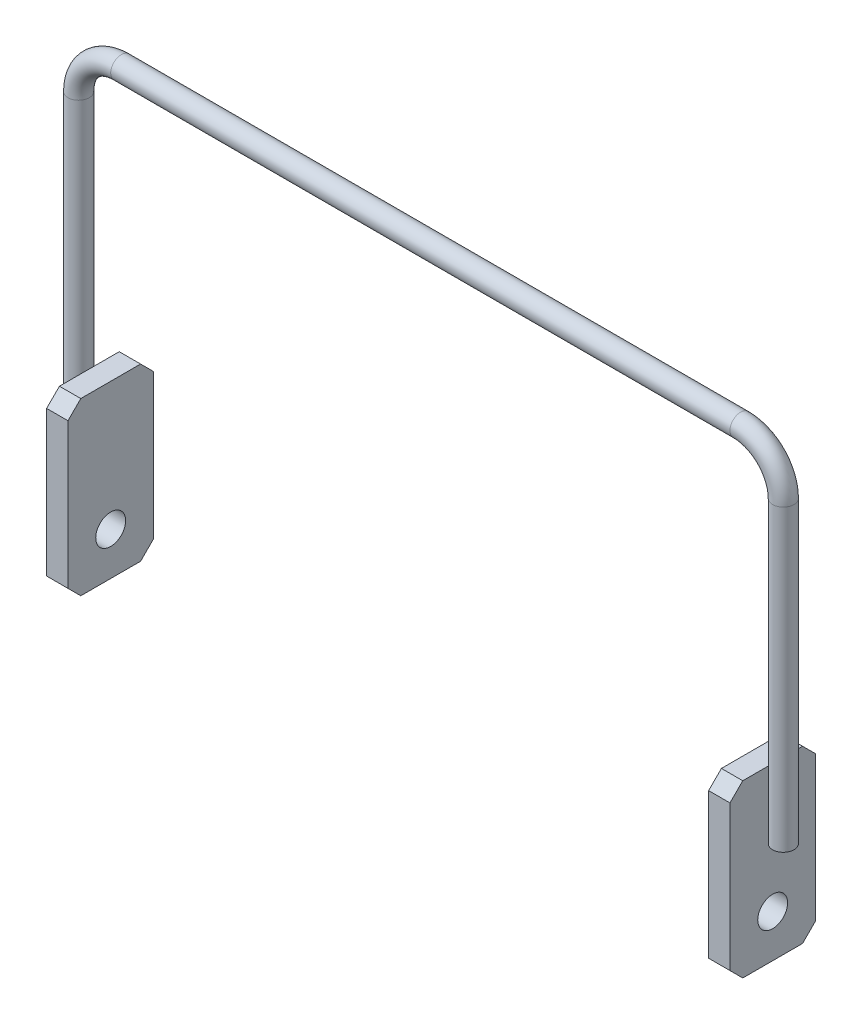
ISO-10303-21;
HEADER;
FILE_DESCRIPTION(('STEP AP214'),'2;1');
FILE_NAME('part.step','',(''),(''),'','','');
FILE_SCHEMA(('AUTOMOTIVE_DESIGN { 1 0 10303 214 1 1 1 1 }'));
ENDSEC;
DATA;
#1=APPLICATION_CONTEXT('core data for automotive mechanical design processes');
#2=APPLICATION_PROTOCOL_DEFINITION('international standard','automotive_design',2000,#1);
#3=PRODUCT_CONTEXT('',#1,'mechanical');
#4=PRODUCT('Part','Part','',(#3));
#5=PRODUCT_RELATED_PRODUCT_CATEGORY('part','',(#4));
#6=PRODUCT_DEFINITION_FORMATION('','',#4);
#7=PRODUCT_DEFINITION_CONTEXT('part definition',#1,'design');
#8=PRODUCT_DEFINITION('design','',#6,#7);
#9=PRODUCT_DEFINITION_SHAPE('','',#8);
#10=(LENGTH_UNIT() NAMED_UNIT(*) SI_UNIT(.MILLI.,.METRE.));
#11=(NAMED_UNIT(*) PLANE_ANGLE_UNIT() SI_UNIT($,.RADIAN.));
#12=(NAMED_UNIT(*) SI_UNIT($,.STERADIAN.) SOLID_ANGLE_UNIT());
#13=UNCERTAINTY_MEASURE_WITH_UNIT(LENGTH_MEASURE(1.E-05),#10,'distance_accuracy_value','');
#14=(GEOMETRIC_REPRESENTATION_CONTEXT(3) GLOBAL_UNCERTAINTY_ASSIGNED_CONTEXT((#13)) GLOBAL_UNIT_ASSIGNED_CONTEXT((#10,
#11,#12)) REPRESENTATION_CONTEXT('',''));
#15=CARTESIAN_POINT('',(0.,0.,0.));
#16=DIRECTION('',(0.,0.,1.));
#17=DIRECTION('',(1.,0.,0.));
#18=AXIS2_PLACEMENT_3D('',#15,#16,#17);
#19=CARTESIAN_POINT('',(-82.5,95.,0.));
#20=DIRECTION('',(0.,-1.,0.));
#21=DIRECTION('',(0.,0.,-1.));
#22=AXIS2_PLACEMENT_3D('',#19,#20,#21);
#23=CYLINDRICAL_SURFACE('',#22,2.49999999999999);
#24=CARTESIAN_POINT('',(-82.5,95.,0.));
#25=DIRECTION('',(0.,-1.,0.));
#26=DIRECTION('',(0.,0.,1.));
#27=AXIS2_PLACEMENT_3D('',#24,#25,#26);
#28=CIRCLE('',#27,2.49999999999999);
#29=CARTESIAN_POINT('',(-85.,95.,0.));
#30=VERTEX_POINT('',#29);
#31=EDGE_CURVE('E47',#30,#30,#28,.T.);
#32=ORIENTED_EDGE('',*,*,#31,.T.);
#33=EDGE_LOOP('',(#32));
#34=FACE_BOUND('',#33,.T.);
#35=CARTESIAN_POINT('',(-82.5,25.,0.));
#36=DIRECTION('',(0.,-1.,0.));
#37=DIRECTION('',(0.,0.,1.));
#38=AXIS2_PLACEMENT_3D('',#35,#36,#37);
#39=CIRCLE('',#38,2.49999999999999);
#40=CARTESIAN_POINT('',(-82.5,25.,2.49999999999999));
#41=VERTEX_POINT('',#40);
#42=EDGE_CURVE('E11',#41,#41,#39,.T.);
#43=ORIENTED_EDGE('',*,*,#42,.F.);
#44=EDGE_LOOP('',(#43));
#45=FACE_BOUND('',#44,.T.);
#46=ADVANCED_FACE('F41',(#34,#45),#23,.T.);
#47=CARTESIAN_POINT('',(-72.5,95.,0.));
#48=DIRECTION('',(0.,0.,1.));
#49=DIRECTION('',(1.,0.,0.));
#50=AXIS2_PLACEMENT_3D('',#47,#48,#49);
#51=TOROIDAL_SURFACE('',#50,10.,2.49999999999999);
#52=CARTESIAN_POINT('',(-72.5,105.,0.));
#53=DIRECTION('',(-1.,0.,0.));
#54=DIRECTION('',(0.,0.,1.));
#55=AXIS2_PLACEMENT_3D('',#52,#53,#54);
#56=CIRCLE('',#55,2.49999999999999);
#57=CARTESIAN_POINT('',(-72.5,107.5,0.));
#58=VERTEX_POINT('',#57);
#59=EDGE_CURVE('E51',#58,#58,#56,.T.);
#60=CARTESIAN_POINT('',(-72.5,95.,0.));
#61=DIRECTION('',(0.,0.,1.));
#62=DIRECTION('',(1.,0.,0.));
#63=AXIS2_PLACEMENT_3D('',#60,#61,#62);
#64=CIRCLE('',#63,12.5);
#65=EDGE_CURVE('',#58,#30,#64,.T.);
#66=ORIENTED_EDGE('',*,*,#59,.T.);
#67=ORIENTED_EDGE('',*,*,#31,.F.);
#68=ORIENTED_EDGE('',*,*,#65,.T.);
#69=ORIENTED_EDGE('',*,*,#65,.F.);
#70=EDGE_LOOP('',(#66,#68,#67,#69));
#71=FACE_BOUND('',#70,.T.);
#72=ADVANCED_FACE('F78',(#71),#51,.T.);
#73=CARTESIAN_POINT('',(72.5,105.,0.));
#74=DIRECTION('',(-1.,0.,0.));
#75=DIRECTION('',(0.,0.,1.));
#76=AXIS2_PLACEMENT_3D('',#73,#74,#75);
#77=CYLINDRICAL_SURFACE('',#76,2.49999999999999);
#78=CARTESIAN_POINT('',(72.5,105.,0.));
#79=DIRECTION('',(-1.,0.,0.));
#80=DIRECTION('',(0.,0.,1.));
#81=AXIS2_PLACEMENT_3D('',#78,#79,#80);
#82=CIRCLE('',#81,2.49999999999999);
#83=CARTESIAN_POINT('',(72.5,107.5,0.));
#84=VERTEX_POINT('',#83);
#85=EDGE_CURVE('E55',#84,#84,#82,.T.);
#86=ORIENTED_EDGE('',*,*,#85,.T.);
#87=EDGE_LOOP('',(#86));
#88=FACE_BOUND('',#87,.T.);
#89=ORIENTED_EDGE('',*,*,#59,.F.);
#90=EDGE_LOOP('',(#89));
#91=FACE_BOUND('',#90,.T.);
#92=ADVANCED_FACE('F82',(#88,#91),#77,.T.);
#93=CARTESIAN_POINT('',(72.5,95.,0.));
#94=DIRECTION('',(0.,0.,1.));
#95=DIRECTION('',(1.,0.,0.));
#96=AXIS2_PLACEMENT_3D('',#93,#94,#95);
#97=TOROIDAL_SURFACE('',#96,9.99999999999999,2.49999999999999);
#98=CARTESIAN_POINT('',(82.5,95.,0.));
#99=DIRECTION('',(0.,1.,0.));
#100=DIRECTION('',(0.,0.,1.));
#101=AXIS2_PLACEMENT_3D('',#98,#99,#100);
#102=CIRCLE('',#101,2.49999999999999);
#103=CARTESIAN_POINT('',(85.,95.,0.));
#104=VERTEX_POINT('',#103);
#105=EDGE_CURVE('E60',#104,#104,#102,.T.);
#106=CARTESIAN_POINT('',(72.5,95.,0.));
#107=DIRECTION('',(0.,0.,1.));
#108=DIRECTION('',(1.,0.,0.));
#109=AXIS2_PLACEMENT_3D('',#106,#107,#108);
#110=CIRCLE('',#109,12.5);
#111=EDGE_CURVE('',#104,#84,#110,.T.);
#112=ORIENTED_EDGE('',*,*,#105,.T.);
#113=ORIENTED_EDGE('',*,*,#85,.F.);
#114=ORIENTED_EDGE('',*,*,#111,.T.);
#115=ORIENTED_EDGE('',*,*,#111,.F.);
#116=EDGE_LOOP('',(#112,#114,#113,#115));
#117=FACE_BOUND('',#116,.T.);
#118=ADVANCED_FACE('F88',(#117),#97,.T.);
#119=CARTESIAN_POINT('',(82.5,95.,0.));
#120=DIRECTION('',(0.,-1.,0.));
#121=DIRECTION('',(0.,0.,-1.));
#122=AXIS2_PLACEMENT_3D('',#119,#120,#121);
#123=CYLINDRICAL_SURFACE('',#122,2.49999999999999);
#124=ORIENTED_EDGE('',*,*,#105,.F.);
#125=EDGE_LOOP('',(#124));
#126=FACE_BOUND('',#125,.T.);
#127=CARTESIAN_POINT('',(82.5,25.,0.));
#128=DIRECTION('',(0.,1.,0.));
#129=DIRECTION('',(0.,0.,1.));
#130=AXIS2_PLACEMENT_3D('',#127,#128,#129);
#131=CIRCLE('',#130,2.49999999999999);
#132=CARTESIAN_POINT('',(82.5,25.,2.49999999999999));
#133=VERTEX_POINT('',#132);
#134=EDGE_CURVE('E63',#133,#133,#131,.T.);
#135=ORIENTED_EDGE('',*,*,#134,.T.);
#136=EDGE_LOOP('',(#135));
#137=FACE_BOUND('',#136,.T.);
#138=ADVANCED_FACE('F67',(#126,#137),#123,.T.);
#139=CARTESIAN_POINT('',(-82.5,25.,0.));
#140=DIRECTION('',(0.,-1.,0.));
#141=DIRECTION('',(0.,0.,1.));
#142=AXIS2_PLACEMENT_3D('',#139,#140,#141);
#143=PLANE('',#142);
#144=ORIENTED_EDGE('',*,*,#42,.T.);
#145=EDGE_LOOP('',(#144));
#146=FACE_BOUND('',#145,.T.);
#147=ADVANCED_FACE('F71',(#146),#143,.T.);
#148=CARTESIAN_POINT('',(82.5,25.,0.));
#149=DIRECTION('',(0.,1.,0.));
#150=DIRECTION('',(0.,0.,1.));
#151=AXIS2_PLACEMENT_3D('',#148,#149,#150);
#152=PLANE('',#151);
#153=ORIENTED_EDGE('',*,*,#134,.F.);
#154=EDGE_LOOP('',(#153));
#155=FACE_BOUND('',#154,.T.);
#156=ADVANCED_FACE('F69',(#155),#152,.F.);
#157=CLOSED_SHELL('',(#46,#72,#92,#118,#138,#147,#156));
#158=MANIFOLD_SOLID_BREP('B2',#157);
#159=CARTESIAN_POINT('',(80.,40.,10.));
#160=DIRECTION('',(0.,-1.,0.));
#161=DIRECTION('',(0.,0.,-1.));
#162=AXIS2_PLACEMENT_3D('',#159,#160,#161);
#163=PLANE('',#162);
#164=DIRECTION('',(0.,0.,-1.));
#165=VECTOR('',#164,1.);
#166=CARTESIAN_POINT('',(80.,40.,10.));
#167=LINE('',#166,#165);
#168=CARTESIAN_POINT('',(80.,40.,6.99999999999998));
#169=VERTEX_POINT('',#168);
#170=CARTESIAN_POINT('',(80.,40.,-7.));
#171=VERTEX_POINT('',#170);
#172=EDGE_CURVE('E279',#169,#171,#167,.T.);
#173=ORIENTED_EDGE('',*,*,#172,.T.);
#174=DIRECTION('',(-1.,0.,0.));
#175=VECTOR('',#174,1.);
#176=CARTESIAN_POINT('',(80.,40.,-7.));
#177=LINE('',#176,#175);
#178=CARTESIAN_POINT('',(75.,40.,-7.));
#179=VERTEX_POINT('',#178);
#180=EDGE_CURVE('E234',#171,#179,#177,.T.);
#181=ORIENTED_EDGE('',*,*,#180,.T.);
#182=DIRECTION('',(0.,0.,-1.));
#183=VECTOR('',#182,1.);
#184=CARTESIAN_POINT('',(75.,40.,10.));
#185=LINE('',#184,#183);
#186=CARTESIAN_POINT('',(75.,40.,6.99999999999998));
#187=VERTEX_POINT('',#186);
#188=EDGE_CURVE('E218',#187,#179,#185,.T.);
#189=ORIENTED_EDGE('',*,*,#188,.F.);
#190=DIRECTION('',(1.,0.,0.));
#191=VECTOR('',#190,1.);
#192=CARTESIAN_POINT('',(80.,40.,6.99999999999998));
#193=LINE('',#192,#191);
#194=EDGE_CURVE('E231',#187,#169,#193,.T.);
#195=ORIENTED_EDGE('',*,*,#194,.T.);
#196=EDGE_LOOP('',(#173,#181,#189,#195));
#197=FACE_BOUND('',#196,.T.);
#198=ADVANCED_FACE('F150',(#197),#163,.F.);
#199=CARTESIAN_POINT('',(75.,40.,10.));
#200=DIRECTION('',(1.,0.,0.));
#201=DIRECTION('',(0.,0.,-1.));
#202=AXIS2_PLACEMENT_3D('',#199,#200,#201);
#203=PLANE('',#202);
#204=CARTESIAN_POINT('',(75.,10.,0.));
#205=DIRECTION('',(1.,0.,0.));
#206=DIRECTION('',(0.,0.,-1.));
#207=AXIS2_PLACEMENT_3D('',#204,#205,#206);
#208=CIRCLE('',#207,3.5);
#209=CARTESIAN_POINT('',(75.,10.,-3.5));
#210=VERTEX_POINT('',#209);
#211=EDGE_CURVE('E329',#210,#210,#208,.T.);
#212=ORIENTED_EDGE('',*,*,#211,.T.);
#213=EDGE_LOOP('',(#212));
#214=FACE_BOUND('',#213,.T.);
#215=ORIENTED_EDGE('',*,*,#188,.T.);
#216=DIRECTION('',(0.,0.707106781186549,0.707106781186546));
#217=VECTOR('',#216,1.);
#218=CARTESIAN_POINT('',(75.,40.,-7.));
#219=LINE('',#218,#217);
#220=CARTESIAN_POINT('',(75.,37.,-10.));
#221=VERTEX_POINT('',#220);
#222=EDGE_CURVE('E225',#179,#221,#219,.F.);
#223=ORIENTED_EDGE('',*,*,#222,.T.);
#224=DIRECTION('',(0.,-1.,0.));
#225=VECTOR('',#224,1.);
#226=CARTESIAN_POINT('',(75.,40.,-10.));
#227=LINE('',#226,#225);
#228=CARTESIAN_POINT('',(75.,3.00000000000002,-10.));
#229=VERTEX_POINT('',#228);
#230=EDGE_CURVE('E292',#221,#229,#227,.T.);
#231=ORIENTED_EDGE('',*,*,#230,.T.);
#232=DIRECTION('',(0.,0.707106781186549,-0.707106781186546));
#233=VECTOR('',#232,1.);
#234=CARTESIAN_POINT('',(75.,0.,-7.));
#235=LINE('',#234,#233);
#236=CARTESIAN_POINT('',(75.,0.,-7.));
#237=VERTEX_POINT('',#236);
#238=EDGE_CURVE('E226',#229,#237,#235,.F.);
#239=ORIENTED_EDGE('',*,*,#238,.T.);
#240=DIRECTION('',(0.,0.,-1.));
#241=VECTOR('',#240,1.);
#242=CARTESIAN_POINT('',(75.,0.,10.));
#243=LINE('',#242,#241);
#244=CARTESIAN_POINT('',(75.,0.,6.99999999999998));
#245=VERTEX_POINT('',#244);
#246=EDGE_CURVE('E235',#245,#237,#243,.T.);
#247=ORIENTED_EDGE('',*,*,#246,.F.);
#248=DIRECTION('',(0.,0.707106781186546,0.707106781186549));
#249=VECTOR('',#248,1.);
#250=CARTESIAN_POINT('',(75.,3.,10.));
#251=LINE('',#250,#249);
#252=CARTESIAN_POINT('',(75.,3.,10.));
#253=VERTEX_POINT('',#252);
#254=EDGE_CURVE('E241',#245,#253,#251,.T.);
#255=ORIENTED_EDGE('',*,*,#254,.T.);
#256=DIRECTION('',(0.,-1.,0.));
#257=VECTOR('',#256,1.);
#258=CARTESIAN_POINT('',(75.,40.,10.));
#259=LINE('',#258,#257);
#260=CARTESIAN_POINT('',(75.,37.,10.));
#261=VERTEX_POINT('',#260);
#262=EDGE_CURVE('E220',#261,#253,#259,.T.);
#263=ORIENTED_EDGE('',*,*,#262,.F.);
#264=DIRECTION('',(0.,0.707106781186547,-0.707106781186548));
#265=VECTOR('',#264,1.);
#266=CARTESIAN_POINT('',(75.,37.,10.));
#267=LINE('',#266,#265);
#268=EDGE_CURVE('E215',#261,#187,#267,.T.);
#269=ORIENTED_EDGE('',*,*,#268,.T.);
#270=EDGE_LOOP('',(#215,#223,#231,#239,#247,#255,#263,#269));
#271=FACE_BOUND('',#270,.T.);
#272=ADVANCED_FACE('F217',(#214,#271),#203,.F.);
#273=CARTESIAN_POINT('',(80.,0.,10.));
#274=DIRECTION('',(0.,1.,0.));
#275=DIRECTION('',(0.,0.,1.));
#276=AXIS2_PLACEMENT_3D('',#273,#274,#275);
#277=PLANE('',#276);
#278=ORIENTED_EDGE('',*,*,#246,.T.);
#279=DIRECTION('',(1.,0.,0.));
#280=VECTOR('',#279,1.);
#281=CARTESIAN_POINT('',(80.,0.,-7.));
#282=LINE('',#281,#280);
#283=CARTESIAN_POINT('',(80.,0.,-7.));
#284=VERTEX_POINT('',#283);
#285=EDGE_CURVE('E39',#237,#284,#282,.T.);
#286=ORIENTED_EDGE('',*,*,#285,.T.);
#287=DIRECTION('',(0.,0.,-1.));
#288=VECTOR('',#287,1.);
#289=CARTESIAN_POINT('',(80.,0.,10.));
#290=LINE('',#289,#288);
#291=CARTESIAN_POINT('',(80.,0.,6.99999999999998));
#292=VERTEX_POINT('',#291);
#293=EDGE_CURVE('E266',#292,#284,#290,.T.);
#294=ORIENTED_EDGE('',*,*,#293,.F.);
#295=DIRECTION('',(-1.,0.,0.));
#296=VECTOR('',#295,1.);
#297=CARTESIAN_POINT('',(75.,0.,6.99999999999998));
#298=LINE('',#297,#296);
#299=EDGE_CURVE('E157',#292,#245,#298,.T.);
#300=ORIENTED_EDGE('',*,*,#299,.T.);
#301=EDGE_LOOP('',(#278,#286,#294,#300));
#302=FACE_BOUND('',#301,.T.);
#303=ADVANCED_FACE('F265',(#302),#277,.F.);
#304=CARTESIAN_POINT('',(80.,40.,10.));
#305=DIRECTION('',(-1.,0.,0.));
#306=DIRECTION('',(0.,0.,1.));
#307=AXIS2_PLACEMENT_3D('',#304,#305,#306);
#308=PLANE('',#307);
#309=CARTESIAN_POINT('',(80.,10.,0.));
#310=DIRECTION('',(-1.,0.,0.));
#311=DIRECTION('',(0.,0.,1.));
#312=AXIS2_PLACEMENT_3D('',#309,#310,#311);
#313=CIRCLE('',#312,3.5);
#314=CARTESIAN_POINT('',(80.,10.,3.5));
#315=VERTEX_POINT('',#314);
#316=EDGE_CURVE('E331',#315,#315,#313,.T.);
#317=ORIENTED_EDGE('',*,*,#316,.T.);
#318=EDGE_LOOP('',(#317));
#319=FACE_BOUND('',#318,.T.);
#320=DIRECTION('',(0.,1.,0.));
#321=VECTOR('',#320,1.);
#322=CARTESIAN_POINT('',(80.,40.,-10.));
#323=LINE('',#322,#321);
#324=CARTESIAN_POINT('',(80.,3.00000000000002,-10.));
#325=VERTEX_POINT('',#324);
#326=CARTESIAN_POINT('',(80.,37.,-10.));
#327=VERTEX_POINT('',#326);
#328=EDGE_CURVE('E282',#325,#327,#323,.T.);
#329=ORIENTED_EDGE('',*,*,#328,.T.);
#330=DIRECTION('',(0.,-0.707106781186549,-0.707106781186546));
#331=VECTOR('',#330,1.);
#332=CARTESIAN_POINT('',(80.,40.,-7.));
#333=LINE('',#332,#331);
#334=EDGE_CURVE('E255',#327,#171,#333,.F.);
#335=ORIENTED_EDGE('',*,*,#334,.T.);
#336=ORIENTED_EDGE('',*,*,#172,.F.);
#337=DIRECTION('',(0.,-0.707106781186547,0.707106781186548));
#338=VECTOR('',#337,1.);
#339=CARTESIAN_POINT('',(80.,37.,10.));
#340=LINE('',#339,#338);
#341=CARTESIAN_POINT('',(80.,37.,10.));
#342=VERTEX_POINT('',#341);
#343=EDGE_CURVE('E239',#169,#342,#340,.T.);
#344=ORIENTED_EDGE('',*,*,#343,.T.);
#345=DIRECTION('',(0.,1.,0.));
#346=VECTOR('',#345,1.);
#347=CARTESIAN_POINT('',(80.,40.,10.));
#348=LINE('',#347,#346);
#349=CARTESIAN_POINT('',(80.,3.,10.));
#350=VERTEX_POINT('',#349);
#351=EDGE_CURVE('E276',#350,#342,#348,.T.);
#352=ORIENTED_EDGE('',*,*,#351,.F.);
#353=DIRECTION('',(0.,-0.707106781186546,-0.707106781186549));
#354=VECTOR('',#353,1.);
#355=CARTESIAN_POINT('',(80.,3.,10.));
#356=LINE('',#355,#354);
#357=EDGE_CURVE('E171',#350,#292,#356,.T.);
#358=ORIENTED_EDGE('',*,*,#357,.T.);
#359=ORIENTED_EDGE('',*,*,#293,.T.);
#360=DIRECTION('',(0.,-0.707106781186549,0.707106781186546));
#361=VECTOR('',#360,1.);
#362=CARTESIAN_POINT('',(80.,0.,-7.));
#363=LINE('',#362,#361);
#364=EDGE_CURVE('E164',#284,#325,#363,.F.);
#365=ORIENTED_EDGE('',*,*,#364,.T.);
#366=EDGE_LOOP('',(#329,#335,#336,#344,#352,#358,#359,#365));
#367=FACE_BOUND('',#366,.T.);
#368=ADVANCED_FACE('F278',(#319,#367),#308,.F.);
#369=CARTESIAN_POINT('',(75.,40.,10.));
#370=DIRECTION('',(0.,0.,1.));
#371=DIRECTION('',(1.,0.,0.));
#372=AXIS2_PLACEMENT_3D('',#369,#370,#371);
#373=PLANE('',#372);
#374=ORIENTED_EDGE('',*,*,#351,.T.);
#375=DIRECTION('',(-1.,0.,0.));
#376=VECTOR('',#375,1.);
#377=CARTESIAN_POINT('',(75.,37.,10.));
#378=LINE('',#377,#376);
#379=EDGE_CURVE('E260',#342,#261,#378,.T.);
#380=ORIENTED_EDGE('',*,*,#379,.T.);
#381=ORIENTED_EDGE('',*,*,#262,.T.);
#382=DIRECTION('',(1.,0.,0.));
#383=VECTOR('',#382,1.);
#384=CARTESIAN_POINT('',(80.,3.,10.));
#385=LINE('',#384,#383);
#386=EDGE_CURVE('E257',#253,#350,#385,.T.);
#387=ORIENTED_EDGE('',*,*,#386,.T.);
#388=EDGE_LOOP('',(#374,#380,#381,#387));
#389=FACE_BOUND('',#388,.T.);
#390=ADVANCED_FACE('F275',(#389),#373,.T.);
#391=CARTESIAN_POINT('',(75.,40.,-10.));
#392=DIRECTION('',(0.,0.,1.));
#393=DIRECTION('',(1.,0.,0.));
#394=AXIS2_PLACEMENT_3D('',#391,#392,#393);
#395=PLANE('',#394);
#396=ORIENTED_EDGE('',*,*,#230,.F.);
#397=DIRECTION('',(1.,0.,0.));
#398=VECTOR('',#397,1.);
#399=CARTESIAN_POINT('',(75.,37.,-10.));
#400=LINE('',#399,#398);
#401=EDGE_CURVE('E250',#221,#327,#400,.T.);
#402=ORIENTED_EDGE('',*,*,#401,.T.);
#403=ORIENTED_EDGE('',*,*,#328,.F.);
#404=DIRECTION('',(-1.,0.,0.));
#405=VECTOR('',#404,1.);
#406=CARTESIAN_POINT('',(75.,3.00000000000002,-10.));
#407=LINE('',#406,#405);
#408=EDGE_CURVE('E248',#325,#229,#407,.T.);
#409=ORIENTED_EDGE('',*,*,#408,.T.);
#410=EDGE_LOOP('',(#396,#402,#403,#409));
#411=FACE_BOUND('',#410,.T.);
#412=ADVANCED_FACE('F290',(#411),#395,.F.);
#413=CARTESIAN_POINT('',(80.,10.,0.));
#414=DIRECTION('',(-1.,0.,0.));
#415=DIRECTION('',(0.,0.,1.));
#416=AXIS2_PLACEMENT_3D('',#413,#414,#415);
#417=CYLINDRICAL_SURFACE('',#416,3.5);
#418=ORIENTED_EDGE('',*,*,#316,.F.);
#419=EDGE_LOOP('',(#418));
#420=FACE_BOUND('',#419,.T.);
#421=ORIENTED_EDGE('',*,*,#211,.F.);
#422=EDGE_LOOP('',(#421));
#423=FACE_BOUND('',#422,.T.);
#424=ADVANCED_FACE('F321',(#420,#423),#417,.F.);
#425=CARTESIAN_POINT('',(80.,40.,-7.));
#426=DIRECTION('',(0.,-0.707106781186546,0.707106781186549));
#427=DIRECTION('',(0.,-0.707106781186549,-0.707106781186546));
#428=AXIS2_PLACEMENT_3D('',#425,#426,#427);
#429=PLANE('',#428);
#430=ORIENTED_EDGE('',*,*,#334,.F.);
#431=ORIENTED_EDGE('',*,*,#401,.F.);
#432=ORIENTED_EDGE('',*,*,#222,.F.);
#433=ORIENTED_EDGE('',*,*,#180,.F.);
#434=EDGE_LOOP('',(#430,#431,#432,#433));
#435=FACE_BOUND('',#434,.T.);
#436=ADVANCED_FACE('F301',(#435),#429,.F.);
#437=CARTESIAN_POINT('',(75.,37.,10.));
#438=DIRECTION('',(0.,0.707106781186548,0.707106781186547));
#439=DIRECTION('',(0.,-0.707106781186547,0.707106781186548));
#440=AXIS2_PLACEMENT_3D('',#437,#438,#439);
#441=PLANE('',#440);
#442=ORIENTED_EDGE('',*,*,#343,.F.);
#443=ORIENTED_EDGE('',*,*,#194,.F.);
#444=ORIENTED_EDGE('',*,*,#268,.F.);
#445=ORIENTED_EDGE('',*,*,#379,.F.);
#446=EDGE_LOOP('',(#442,#443,#444,#445));
#447=FACE_BOUND('',#446,.T.);
#448=ADVANCED_FACE('F238',(#447),#441,.T.);
#449=CARTESIAN_POINT('',(80.,0.,-7.));
#450=DIRECTION('',(0.,0.707106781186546,0.707106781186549));
#451=DIRECTION('',(0.,-0.707106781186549,0.707106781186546));
#452=AXIS2_PLACEMENT_3D('',#449,#450,#451);
#453=PLANE('',#452);
#454=ORIENTED_EDGE('',*,*,#238,.F.);
#455=ORIENTED_EDGE('',*,*,#408,.F.);
#456=ORIENTED_EDGE('',*,*,#364,.F.);
#457=ORIENTED_EDGE('',*,*,#285,.F.);
#458=EDGE_LOOP('',(#454,#455,#456,#457));
#459=FACE_BOUND('',#458,.T.);
#460=ADVANCED_FACE('F293',(#459),#453,.F.);
#461=CARTESIAN_POINT('',(75.,3.,10.));
#462=DIRECTION('',(0.,-0.707106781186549,0.707106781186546));
#463=DIRECTION('',(0.,-0.707106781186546,-0.707106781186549));
#464=AXIS2_PLACEMENT_3D('',#461,#462,#463);
#465=PLANE('',#464);
#466=ORIENTED_EDGE('',*,*,#254,.F.);
#467=ORIENTED_EDGE('',*,*,#299,.F.);
#468=ORIENTED_EDGE('',*,*,#357,.F.);
#469=ORIENTED_EDGE('',*,*,#386,.F.);
#470=EDGE_LOOP('',(#466,#467,#468,#469));
#471=FACE_BOUND('',#470,.T.);
#472=ADVANCED_FACE('F272',(#471),#465,.T.);
#473=CLOSED_SHELL('',(#198,#272,#303,#368,#390,#412,#424,#436,#448,#460,#472));
#474=MANIFOLD_SOLID_BREP('B6',#473);
#475=CARTESIAN_POINT('',(-80.,40.,10.));
#476=DIRECTION('',(1.,0.,0.));
#477=DIRECTION('',(0.,0.,-1.));
#478=AXIS2_PLACEMENT_3D('',#475,#476,#477);
#479=PLANE('',#478);
#480=CARTESIAN_POINT('',(-80.,10.,0.));
#481=DIRECTION('',(-1.,0.,0.));
#482=DIRECTION('',(0.,0.,1.));
#483=AXIS2_PLACEMENT_3D('',#480,#481,#482);
#484=CIRCLE('',#483,3.5);
#485=CARTESIAN_POINT('',(-80.,10.,3.5));
#486=VERTEX_POINT('',#485);
#487=EDGE_CURVE('E545',#486,#486,#484,.T.);
#488=ORIENTED_EDGE('',*,*,#487,.F.);
#489=EDGE_LOOP('',(#488));
#490=FACE_BOUND('',#489,.T.);
#491=DIRECTION('',(0.,0.,-1.));
#492=VECTOR('',#491,1.);
#493=CARTESIAN_POINT('',(-80.,40.,10.));
#494=LINE('',#493,#492);
#495=CARTESIAN_POINT('',(-80.,40.,6.99999999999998));
#496=VERTEX_POINT('',#495);
#497=CARTESIAN_POINT('',(-80.,40.,-7.));
#498=VERTEX_POINT('',#497);
#499=EDGE_CURVE('E466',#496,#498,#494,.T.);
#500=ORIENTED_EDGE('',*,*,#499,.T.);
#501=DIRECTION('',(0.,0.707106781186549,0.707106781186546));
#502=VECTOR('',#501,1.);
#503=CARTESIAN_POINT('',(-80.,40.,-7.));
#504=LINE('',#503,#502);
#505=CARTESIAN_POINT('',(-80.,37.,-10.));
#506=VERTEX_POINT('',#505);
#507=EDGE_CURVE('E500',#498,#506,#504,.F.);
#508=ORIENTED_EDGE('',*,*,#507,.T.);
#509=DIRECTION('',(0.,-1.,0.));
#510=VECTOR('',#509,1.);
#511=CARTESIAN_POINT('',(-80.,40.,-10.));
#512=LINE('',#511,#510);
#513=CARTESIAN_POINT('',(-80.,3.00000000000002,-10.));
#514=VERTEX_POINT('',#513);
#515=EDGE_CURVE('E541',#506,#514,#512,.T.);
#516=ORIENTED_EDGE('',*,*,#515,.T.);
#517=DIRECTION('',(0.,0.707106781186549,-0.707106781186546));
#518=VECTOR('',#517,1.);
#519=CARTESIAN_POINT('',(-80.,0.,-7.));
#520=LINE('',#519,#518);
#521=CARTESIAN_POINT('',(-80.,0.,-7.));
#522=VERTEX_POINT('',#521);
#523=EDGE_CURVE('E472',#514,#522,#520,.F.);
#524=ORIENTED_EDGE('',*,*,#523,.T.);
#525=DIRECTION('',(0.,0.,-1.));
#526=VECTOR('',#525,1.);
#527=CARTESIAN_POINT('',(-80.,0.,10.));
#528=LINE('',#527,#526);
#529=CARTESIAN_POINT('',(-80.,0.,6.99999999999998));
#530=VERTEX_POINT('',#529);
#531=EDGE_CURVE('E489',#530,#522,#528,.T.);
#532=ORIENTED_EDGE('',*,*,#531,.F.);
#533=DIRECTION('',(0.,0.707106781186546,0.707106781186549));
#534=VECTOR('',#533,1.);
#535=CARTESIAN_POINT('',(-80.,3.,10.));
#536=LINE('',#535,#534);
#537=CARTESIAN_POINT('',(-80.,3.,10.));
#538=VERTEX_POINT('',#537);
#539=EDGE_CURVE('E473',#530,#538,#536,.T.);
#540=ORIENTED_EDGE('',*,*,#539,.T.);
#541=DIRECTION('',(0.,-1.,0.));
#542=VECTOR('',#541,1.);
#543=CARTESIAN_POINT('',(-80.,40.,10.));
#544=LINE('',#543,#542);
#545=CARTESIAN_POINT('',(-80.,37.,10.));
#546=VERTEX_POINT('',#545);
#547=EDGE_CURVE('E468',#546,#538,#544,.T.);
#548=ORIENTED_EDGE('',*,*,#547,.F.);
#549=DIRECTION('',(0.,0.707106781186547,-0.707106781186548));
#550=VECTOR('',#549,1.);
#551=CARTESIAN_POINT('',(-80.,37.,10.));
#552=LINE('',#551,#550);
#553=EDGE_CURVE('E464',#546,#496,#552,.T.);
#554=ORIENTED_EDGE('',*,*,#553,.T.);
#555=EDGE_LOOP('',(#500,#508,#516,#524,#532,#540,#548,#554));
#556=FACE_BOUND('',#555,.T.);
#557=ADVANCED_FACE('F398',(#490,#556),#479,.F.);
#558=CARTESIAN_POINT('',(-80.,0.,10.));
#559=DIRECTION('',(0.,1.,0.));
#560=DIRECTION('',(0.,0.,1.));
#561=AXIS2_PLACEMENT_3D('',#558,#559,#560);
#562=PLANE('',#561);
#563=ORIENTED_EDGE('',*,*,#531,.T.);
#564=DIRECTION('',(1.,0.,0.));
#565=VECTOR('',#564,1.);
#566=CARTESIAN_POINT('',(-80.,0.,-7.));
#567=LINE('',#566,#565);
#568=CARTESIAN_POINT('',(-75.,0.,-7.));
#569=VERTEX_POINT('',#568);
#570=EDGE_CURVE('E513',#522,#569,#567,.T.);
#571=ORIENTED_EDGE('',*,*,#570,.T.);
#572=DIRECTION('',(0.,0.,-1.));
#573=VECTOR('',#572,1.);
#574=CARTESIAN_POINT('',(-75.,0.,10.));
#575=LINE('',#574,#573);
#576=CARTESIAN_POINT('',(-75.,0.,6.99999999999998));
#577=VERTEX_POINT('',#576);
#578=EDGE_CURVE('E493',#577,#569,#575,.T.);
#579=ORIENTED_EDGE('',*,*,#578,.F.);
#580=DIRECTION('',(-1.,0.,0.));
#581=VECTOR('',#580,1.);
#582=CARTESIAN_POINT('',(-80.,0.,6.99999999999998));
#583=LINE('',#582,#581);
#584=EDGE_CURVE('E511',#577,#530,#583,.T.);
#585=ORIENTED_EDGE('',*,*,#584,.T.);
#586=EDGE_LOOP('',(#563,#571,#579,#585));
#587=FACE_BOUND('',#586,.T.);
#588=ADVANCED_FACE('F532',(#587),#562,.F.);
#589=CARTESIAN_POINT('',(-75.,40.,10.));
#590=DIRECTION('',(-1.,0.,0.));
#591=DIRECTION('',(0.,0.,1.));
#592=AXIS2_PLACEMENT_3D('',#589,#590,#591);
#593=PLANE('',#592);
#594=CARTESIAN_POINT('',(-75.,10.,0.));
#595=DIRECTION('',(-1.,0.,0.));
#596=DIRECTION('',(0.,0.,1.));
#597=AXIS2_PLACEMENT_3D('',#594,#595,#596);
#598=CIRCLE('',#597,3.5);
#599=CARTESIAN_POINT('',(-75.,10.,3.5));
#600=VERTEX_POINT('',#599);
#601=EDGE_CURVE('E496',#600,#600,#598,.T.);
#602=ORIENTED_EDGE('',*,*,#601,.T.);
#603=EDGE_LOOP('',(#602));
#604=FACE_BOUND('',#603,.T.);
#605=DIRECTION('',(0.,1.,0.));
#606=VECTOR('',#605,1.);
#607=CARTESIAN_POINT('',(-75.,40.,-10.));
#608=LINE('',#607,#606);
#609=CARTESIAN_POINT('',(-75.,3.00000000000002,-10.));
#610=VERTEX_POINT('',#609);
#611=CARTESIAN_POINT('',(-75.,37.,-10.));
#612=VERTEX_POINT('',#611);
#613=EDGE_CURVE('E524',#610,#612,#608,.T.);
#614=ORIENTED_EDGE('',*,*,#613,.T.);
#615=DIRECTION('',(0.,-0.707106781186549,-0.707106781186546));
#616=VECTOR('',#615,1.);
#617=CARTESIAN_POINT('',(-75.,40.,-7.));
#618=LINE('',#617,#616);
#619=CARTESIAN_POINT('',(-75.,40.,-7.));
#620=VERTEX_POINT('',#619);
#621=EDGE_CURVE('E509',#612,#620,#618,.F.);
#622=ORIENTED_EDGE('',*,*,#621,.T.);
#623=DIRECTION('',(0.,0.,-1.));
#624=VECTOR('',#623,1.);
#625=CARTESIAN_POINT('',(-75.,40.,10.));
#626=LINE('',#625,#624);
#627=CARTESIAN_POINT('',(-75.,40.,6.99999999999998));
#628=VERTEX_POINT('',#627);
#629=EDGE_CURVE('E483',#628,#620,#626,.T.);
#630=ORIENTED_EDGE('',*,*,#629,.F.);
#631=DIRECTION('',(0.,-0.707106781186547,0.707106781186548));
#632=VECTOR('',#631,1.);
#633=CARTESIAN_POINT('',(-75.,37.,10.));
#634=LINE('',#633,#632);
#635=CARTESIAN_POINT('',(-75.,37.,10.));
#636=VERTEX_POINT('',#635);
#637=EDGE_CURVE('E488',#628,#636,#634,.T.);
#638=ORIENTED_EDGE('',*,*,#637,.T.);
#639=DIRECTION('',(0.,1.,0.));
#640=VECTOR('',#639,1.);
#641=CARTESIAN_POINT('',(-75.,40.,10.));
#642=LINE('',#641,#640);
#643=CARTESIAN_POINT('',(-75.,3.,10.));
#644=VERTEX_POINT('',#643);
#645=EDGE_CURVE('E484',#644,#636,#642,.T.);
#646=ORIENTED_EDGE('',*,*,#645,.F.);
#647=DIRECTION('',(0.,-0.707106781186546,-0.707106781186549));
#648=VECTOR('',#647,1.);
#649=CARTESIAN_POINT('',(-75.,3.,10.));
#650=LINE('',#649,#648);
#651=EDGE_CURVE('E420',#644,#577,#650,.T.);
#652=ORIENTED_EDGE('',*,*,#651,.T.);
#653=ORIENTED_EDGE('',*,*,#578,.T.);
#654=DIRECTION('',(0.,-0.707106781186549,0.707106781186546));
#655=VECTOR('',#654,1.);
#656=CARTESIAN_POINT('',(-75.,0.,-7.));
#657=LINE('',#656,#655);
#658=EDGE_CURVE('E412',#569,#610,#657,.F.);
#659=ORIENTED_EDGE('',*,*,#658,.T.);
#660=EDGE_LOOP('',(#614,#622,#630,#638,#646,#652,#653,#659));
#661=FACE_BOUND('',#660,.T.);
#662=ADVANCED_FACE('F522',(#604,#661),#593,.F.);
#663=CARTESIAN_POINT('',(-80.,40.,10.));
#664=DIRECTION('',(0.,-1.,0.));
#665=DIRECTION('',(0.,0.,-1.));
#666=AXIS2_PLACEMENT_3D('',#663,#664,#665);
#667=PLANE('',#666);
#668=ORIENTED_EDGE('',*,*,#629,.T.);
#669=DIRECTION('',(-1.,0.,0.));
#670=VECTOR('',#669,1.);
#671=CARTESIAN_POINT('',(-80.,40.,-7.));
#672=LINE('',#671,#670);
#673=EDGE_CURVE('E482',#620,#498,#672,.T.);
#674=ORIENTED_EDGE('',*,*,#673,.T.);
#675=ORIENTED_EDGE('',*,*,#499,.F.);
#676=DIRECTION('',(1.,0.,0.));
#677=VECTOR('',#676,1.);
#678=CARTESIAN_POINT('',(-75.,40.,6.99999999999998));
#679=LINE('',#678,#677);
#680=EDGE_CURVE('E479',#496,#628,#679,.T.);
#681=ORIENTED_EDGE('',*,*,#680,.T.);
#682=EDGE_LOOP('',(#668,#674,#675,#681));
#683=FACE_BOUND('',#682,.T.);
#684=ADVANCED_FACE('F478',(#683),#667,.F.);
#685=CARTESIAN_POINT('',(-80.,0.,10.));
#686=DIRECTION('',(0.,0.,1.));
#687=DIRECTION('',(1.,0.,0.));
#688=AXIS2_PLACEMENT_3D('',#685,#686,#687);
#689=PLANE('',#688);
#690=ORIENTED_EDGE('',*,*,#645,.T.);
#691=DIRECTION('',(-1.,0.,0.));
#692=VECTOR('',#691,1.);
#693=CARTESIAN_POINT('',(-80.,37.,10.));
#694=LINE('',#693,#692);
#695=EDGE_CURVE('E148',#636,#546,#694,.T.);
#696=ORIENTED_EDGE('',*,*,#695,.T.);
#697=ORIENTED_EDGE('',*,*,#547,.T.);
#698=DIRECTION('',(1.,0.,0.));
#699=VECTOR('',#698,1.);
#700=CARTESIAN_POINT('',(-75.,3.,10.));
#701=LINE('',#700,#699);
#702=EDGE_CURVE('E405',#538,#644,#701,.T.);
#703=ORIENTED_EDGE('',*,*,#702,.T.);
#704=EDGE_LOOP('',(#690,#696,#697,#703));
#705=FACE_BOUND('',#704,.T.);
#706=ADVANCED_FACE('F518',(#705),#689,.T.);
#707=CARTESIAN_POINT('',(-80.,0.,-10.));
#708=DIRECTION('',(0.,0.,1.));
#709=DIRECTION('',(1.,0.,0.));
#710=AXIS2_PLACEMENT_3D('',#707,#708,#709);
#711=PLANE('',#710);
#712=ORIENTED_EDGE('',*,*,#515,.F.);
#713=DIRECTION('',(1.,0.,0.));
#714=VECTOR('',#713,1.);
#715=CARTESIAN_POINT('',(-80.,37.,-10.));
#716=LINE('',#715,#714);
#717=EDGE_CURVE('E504',#506,#612,#716,.T.);
#718=ORIENTED_EDGE('',*,*,#717,.T.);
#719=ORIENTED_EDGE('',*,*,#613,.F.);
#720=DIRECTION('',(-1.,0.,0.));
#721=VECTOR('',#720,1.);
#722=CARTESIAN_POINT('',(-80.,3.00000000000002,-10.));
#723=LINE('',#722,#721);
#724=EDGE_CURVE('E502',#610,#514,#723,.T.);
#725=ORIENTED_EDGE('',*,*,#724,.T.);
#726=EDGE_LOOP('',(#712,#718,#719,#725));
#727=FACE_BOUND('',#726,.T.);
#728=ADVANCED_FACE('F540',(#727),#711,.F.);
#729=CARTESIAN_POINT('',(80.,10.,0.));
#730=DIRECTION('',(-1.,0.,0.));
#731=DIRECTION('',(0.,0.,1.));
#732=AXIS2_PLACEMENT_3D('',#729,#730,#731);
#733=CYLINDRICAL_SURFACE('',#732,3.5);
#734=ORIENTED_EDGE('',*,*,#487,.T.);
#735=EDGE_LOOP('',(#734));
#736=FACE_BOUND('',#735,.T.);
#737=ORIENTED_EDGE('',*,*,#601,.F.);
#738=EDGE_LOOP('',(#737));
#739=FACE_BOUND('',#738,.T.);
#740=ADVANCED_FACE('F550',(#736,#739),#733,.F.);
#741=CARTESIAN_POINT('',(-80.,40.,-7.));
#742=DIRECTION('',(0.,-0.707106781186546,0.707106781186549));
#743=DIRECTION('',(0.,-0.707106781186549,-0.707106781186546));
#744=AXIS2_PLACEMENT_3D('',#741,#742,#743);
#745=PLANE('',#744);
#746=ORIENTED_EDGE('',*,*,#621,.F.);
#747=ORIENTED_EDGE('',*,*,#717,.F.);
#748=ORIENTED_EDGE('',*,*,#507,.F.);
#749=ORIENTED_EDGE('',*,*,#673,.F.);
#750=EDGE_LOOP('',(#746,#747,#748,#749));
#751=FACE_BOUND('',#750,.T.);
#752=ADVANCED_FACE('F571',(#751),#745,.F.);
#753=CARTESIAN_POINT('',(-80.,0.,-7.));
#754=DIRECTION('',(0.,0.707106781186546,0.707106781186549));
#755=DIRECTION('',(0.,-0.707106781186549,0.707106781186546));
#756=AXIS2_PLACEMENT_3D('',#753,#754,#755);
#757=PLANE('',#756);
#758=ORIENTED_EDGE('',*,*,#523,.F.);
#759=ORIENTED_EDGE('',*,*,#724,.F.);
#760=ORIENTED_EDGE('',*,*,#658,.F.);
#761=ORIENTED_EDGE('',*,*,#570,.F.);
#762=EDGE_LOOP('',(#758,#759,#760,#761));
#763=FACE_BOUND('',#762,.T.);
#764=ADVANCED_FACE('F537',(#763),#757,.F.);
#765=CARTESIAN_POINT('',(-80.,37.,10.));
#766=DIRECTION('',(0.,0.707106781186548,0.707106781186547));
#767=DIRECTION('',(0.,-0.707106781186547,0.707106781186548));
#768=AXIS2_PLACEMENT_3D('',#765,#766,#767);
#769=PLANE('',#768);
#770=ORIENTED_EDGE('',*,*,#637,.F.);
#771=ORIENTED_EDGE('',*,*,#680,.F.);
#772=ORIENTED_EDGE('',*,*,#553,.F.);
#773=ORIENTED_EDGE('',*,*,#695,.F.);
#774=EDGE_LOOP('',(#770,#771,#772,#773));
#775=FACE_BOUND('',#774,.T.);
#776=ADVANCED_FACE('F487',(#775),#769,.T.);
#777=CARTESIAN_POINT('',(-80.,3.,10.));
#778=DIRECTION('',(0.,-0.707106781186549,0.707106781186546));
#779=DIRECTION('',(0.,-0.707106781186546,-0.707106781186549));
#780=AXIS2_PLACEMENT_3D('',#777,#778,#779);
#781=PLANE('',#780);
#782=ORIENTED_EDGE('',*,*,#539,.F.);
#783=ORIENTED_EDGE('',*,*,#584,.F.);
#784=ORIENTED_EDGE('',*,*,#651,.F.);
#785=ORIENTED_EDGE('',*,*,#702,.F.);
#786=EDGE_LOOP('',(#782,#783,#784,#785));
#787=FACE_BOUND('',#786,.T.);
#788=ADVANCED_FACE('F534',(#787),#781,.T.);
#789=CLOSED_SHELL('',(#557,#588,#662,#684,#706,#728,#740,#752,#764,#776,#788));
#790=MANIFOLD_SOLID_BREP('B33',#789);
#791=ADVANCED_BREP_SHAPE_REPRESENTATION('',(#18,#158,#474,#790),#14);
#792=SHAPE_DEFINITION_REPRESENTATION(#9,#791);
ENDSEC;
END-ISO-10303-21;
